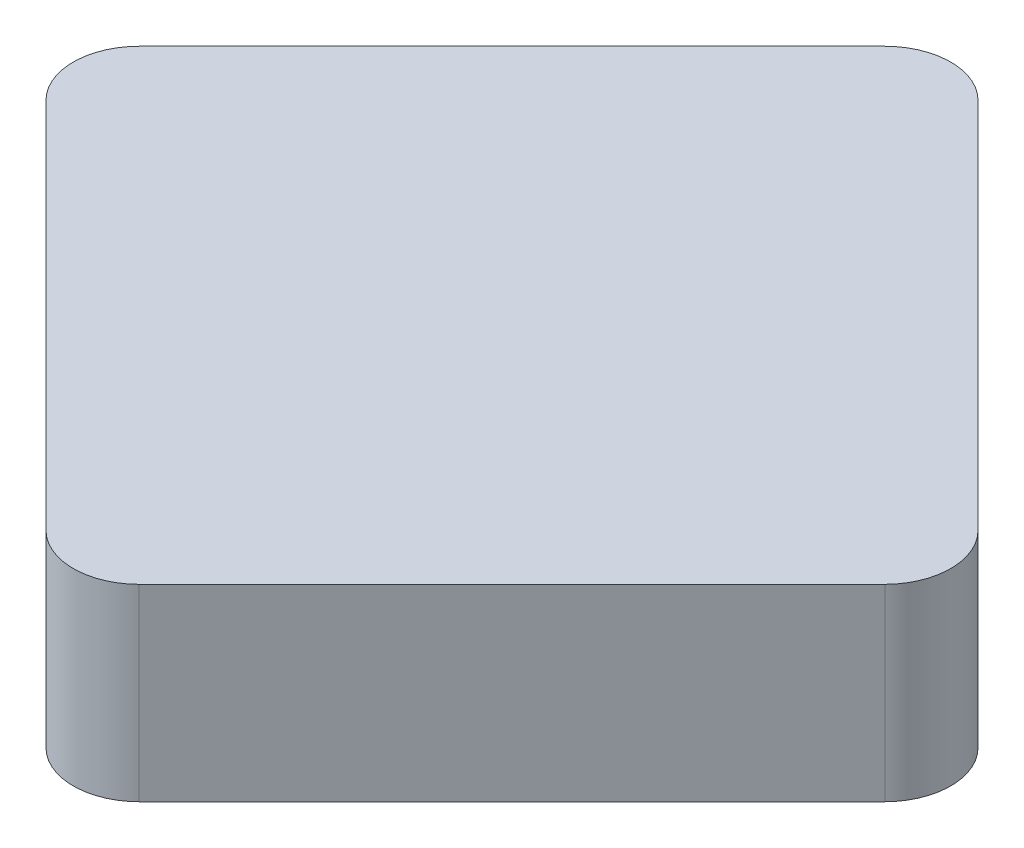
from build123d import *

# Parameters (mm, degrees)
ESQCORPS_R       = 0.0005
CORPS_DEPTH      = 0.0005
PLAQUETTEC_DEPTH = 3.428571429


with BuildPart() as part:
    # EsqCorps → Corps (new, symmetric)
    with BuildSketch(Plane(origin=(0, 0, 0), x_dir=(1, 0, 0), z_dir=(0, 1, 0))):
        with Locations(Location((0, 0, 0), (0, 0, 270))):
            Circle(ESQCORPS_R)
    extrude(amount=CORPS_DEPTH, both=True)

    # EsqC → PlaquetteC (add)
    with BuildSketch(Plane(origin=(0, 0, 0), x_dir=(1, 0, 0), z_dir=(0, 1, 0))):
        with BuildLine():
            Line((-0.848528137, -0.848528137), (5.939696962, -7.636753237))
            ThreePointArc((5.939696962, -7.636753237), (6.788225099, -7.988225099), (7.636753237, -7.636753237))
            Line((7.636753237, -7.636753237), (14.424978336, -0.848528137))
            ThreePointArc((14.424978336, -0.848528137), (14.776450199, 0), (14.424978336, 0.848528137))
            Line((14.424978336, 0.848528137), (7.636753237, 7.636753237))
            ThreePointArc((7.636753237, 7.636753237), (6.788225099, 7.988225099), (5.939696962, 7.636753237))
            Line((5.939696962, 7.636753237), (-0.848528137, 0.848528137))
            ThreePointArc((-0.848528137, 0.848528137), (-1.2, 0), (-0.848528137, -0.848528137))
        make_face()
    extrude(amount=-PLAQUETTEC_DEPTH)


solid = part.part
